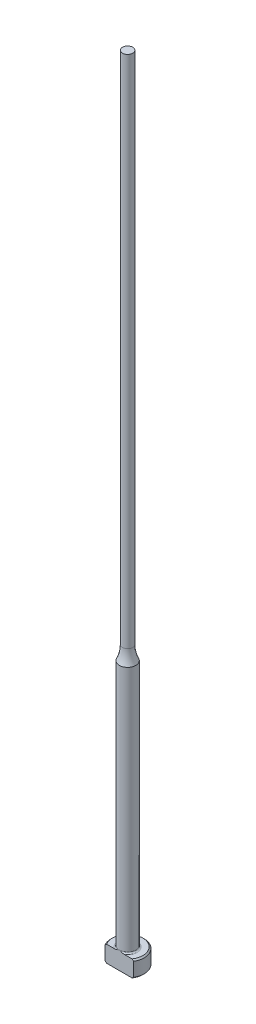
from build123d import *

# Parameters (mm, degrees)
CHAMFER1_SIZE      = 0.254
FILLET1_R          = 0.254
CUT_EXTRUDE1_DEPTH = 153.466131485


with BuildPart() as part:
    # Sketch1 → Revolve1 (revolve)
    with BuildSketch(Plane.XY, mode=Mode.PRIVATE) as revolve1_sk:
        with BuildLine():
            Line((0, 0), (-3.175, 0))
            Line((-3.175, 0), (-3.175, 3.175))
            Line((-3.175, 3.175), (-1.5875, 3.175))
            Line((-1.5875, 3.175), (-1.5875, 50.8))
            ThreePointArc((-1.5875, 50.8), (-1.142565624, 52.109911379), (-0.99187, 53.485093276))
            Line((-0.99187, 53.485093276), (-0.99187, 152.4))
            Line((-0.99187, 152.4), (0, 152.4))
            Line((0, 152.4), (0, 0))
        make_face()
    revolve(revolve1_sk.sketch.rotate(Axis((0, 259.958771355, 0), (0, -1, 0)), 270), axis=Axis((0, 259.958771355, 0), (0, -1, 0)))

    # Chamfer1
    chamfer1_edges = [part.edges().sort_by_distance(p)[0] for p in [
        (0, 0, -3.175),
        (0, 3.175, -3.175),
    ]]
    chamfer(chamfer1_edges, length=CHAMFER1_SIZE)

    # Fillet1
    fillet1_edges = [part.edges().sort_by_distance(p)[0] for p in [
        (0, 3.175, -1.5875),
    ]]
    fillet(fillet1_edges, radius=FILLET1_R)

    # Sketch2 → Cut-Extrude1 (cut, through all)
    with BuildSketch(Plane.XZ):
        with BuildLine():
            Line((-2.749630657, 1.5875), (2.749630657, 1.5875))
            ThreePointArc((2.749630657, 1.5875), (0, 3.175), (-2.749630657, 1.5875))
        make_face()
    extrude(amount=-CUT_EXTRUDE1_DEPTH, mode=Mode.SUBTRACT)


solid = part.part
